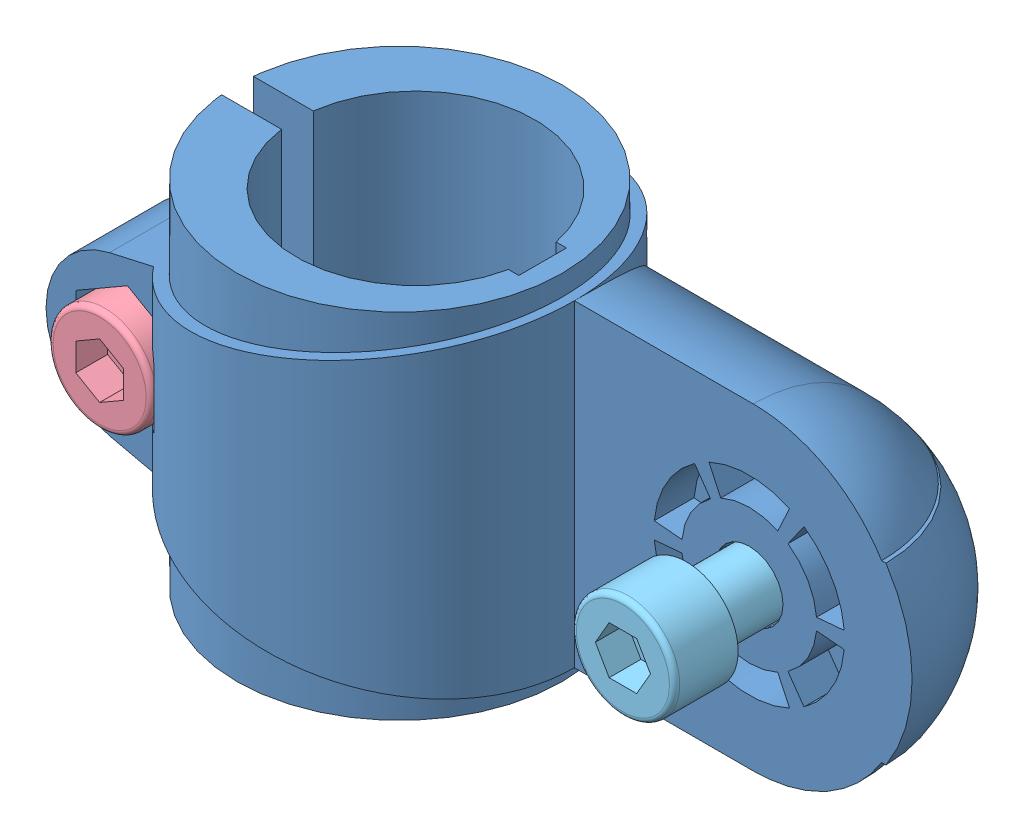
SolidWorks assembly TCC30-TP-S-G.sldasm, configuration Default (file format 15000). Lengths in mm.
Overall size (96.89 44.5 44.85).
5 component instances, 5 part files, 0 mates.
Components (placement in the parent):
- TCC30-TP-S-G_01-1: TCC30-TP-S-G_01.sldprt [ﾃﾞﾌｫﾙﾄ] at origin size (95 44.5 44.85)
- TCC30-TP-S-G_02-1: TCC30-TP-S-G_02.sldprt [ﾃﾞﾌｫﾙﾄ] at (-40.25 0 -9.5) x (0.866025 -0.5 0) z (0.5 0.866025 0) size (17.77 8.01 17.77)
- TCC30-TP-S-G_03-1: TCC30-TP-S-G_03.sldprt [ﾃﾞﾌｫﾙﾄ] at (24 0 -10.5) x (1 0 0) z (0 1 0) size (17.77 8.01 17.77)
- TCC30-TP-S-G_04-1: TCC30-TP-S-G_04.sldprt [ﾃﾞﾌｫﾙﾄ] at (-40.25 0 9.5) x (0.866025 -0.5 0) z (-0.5 -0.866025 0) size (13 33 13)
- TCC30-TP-S-G_05-1: TCC30-TP-S-G_05.sldprt [ﾃﾞﾌｫﾙﾄ] at (24 0 7.9) x (-0.5 -0.866025 0) z (-0.866025 0.5 0) size (13 33 13)
